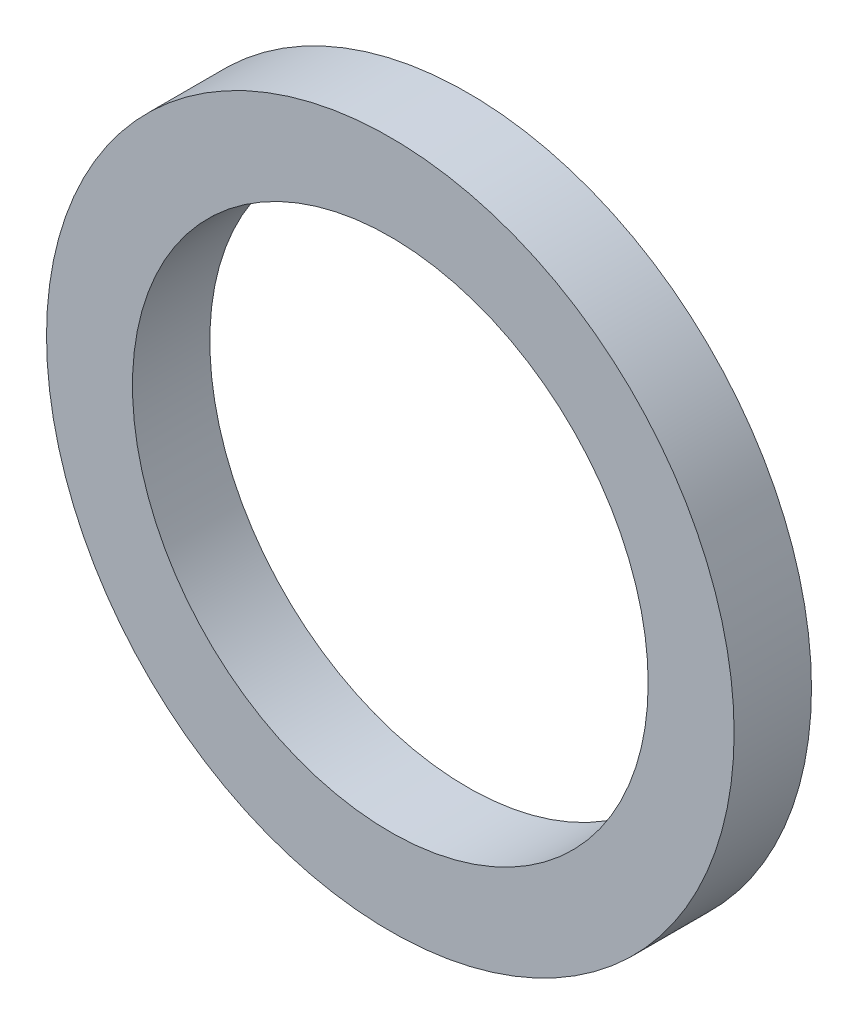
from build123d import *

# Parameters (mm, degrees)
ESQUISSE1_R          = 20
ESQUISSE1_R_2        = 15
BASE_EXTRUSION_DEPTH = 4.5


with BuildPart() as part:
    # Esquisse1 → Base-Extrusion (new body)
    with BuildSketch(Plane.XY):
        Circle(ESQUISSE1_R)
        Circle(ESQUISSE1_R_2, mode=Mode.SUBTRACT)
    extrude(amount=BASE_EXTRUSION_DEPTH)


solid = part.part
